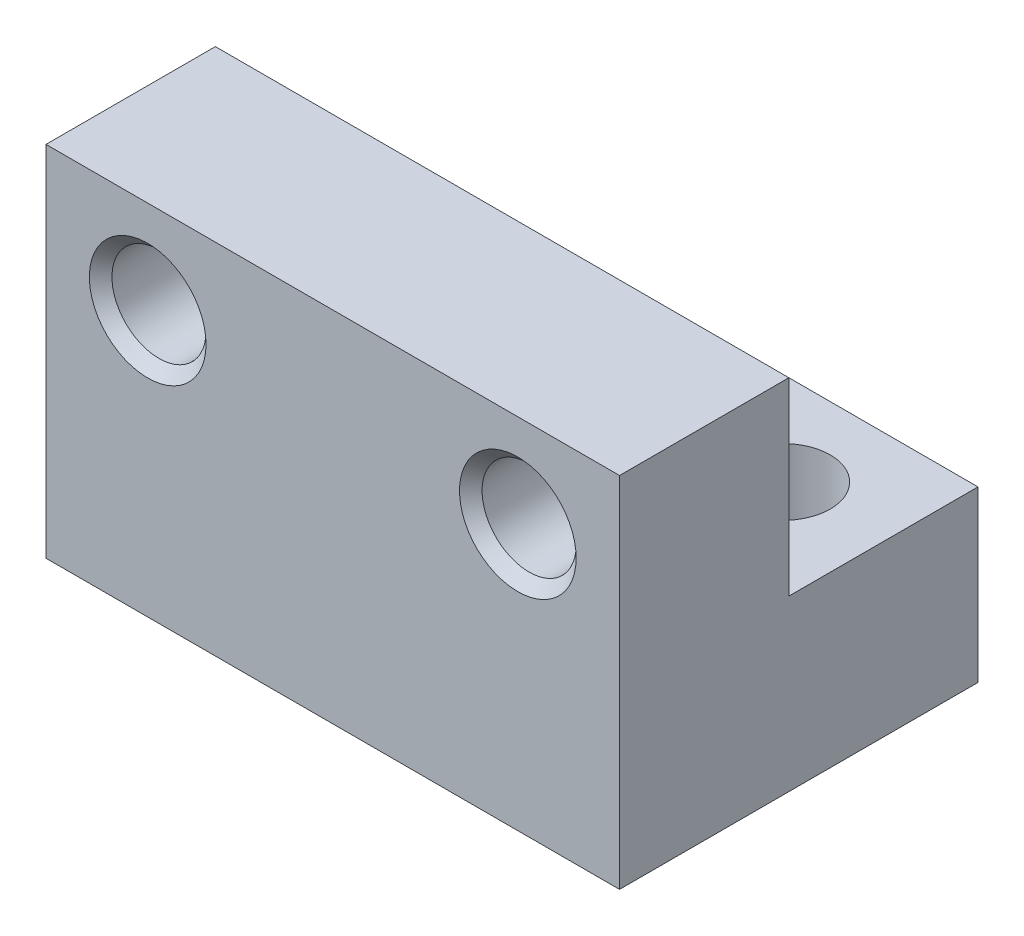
from build123d import *

# Parameters (mm, degrees)
BOSS_EXTRUDE1_DEPTH   = 15.24
M3X0_5_TAPPED_HOLE1_D = 2.5
M3X0_5_TAPPED_HOLE2_D = 2.5
CHAMFER1_SIZE         = 0.3


with BuildPart() as part:
    # Sketch1 → Boss-Extrude1 (new body)
    with BuildSketch(Plane(origin=(0, 0, 0), x_dir=(0, 0, -1), z_dir=(1, 0, 0))):
        Polygon((9.525, 0), (0, 0), (0, 9.525), (4.5, 9.525), (4.5, 4.5), (9.525, 4.5), align=None)
    extrude(amount=BOSS_EXTRUDE1_DEPTH)

    # M3x0.5 Tapped Hole1 (through all)
    with Locations(Plane.XY):
        with Locations((2.7025, 7.05), (12.5375, 7.05)):
            Hole(M3X0_5_TAPPED_HOLE1_D / 2)

    # M3x0.5 Tapped Hole2 (through all)
    with Locations(Plane.XZ):
        with Locations((12.5375, -7.05), (2.7025, -7.05)):
            Hole(M3X0_5_TAPPED_HOLE2_D / 2)

    # Chamfer1
    chamfer1_edges = [part.edges().sort_by_distance(p)[0] for p in [
        (13.7875, 7.05, 0),
        (3.9525, 7.05, 0),
        (3.9525, 0, -7.05),
        (13.7875, 0, -7.05),
    ]]
    chamfer(chamfer1_edges, length=CHAMFER1_SIZE)


solid = part.part
